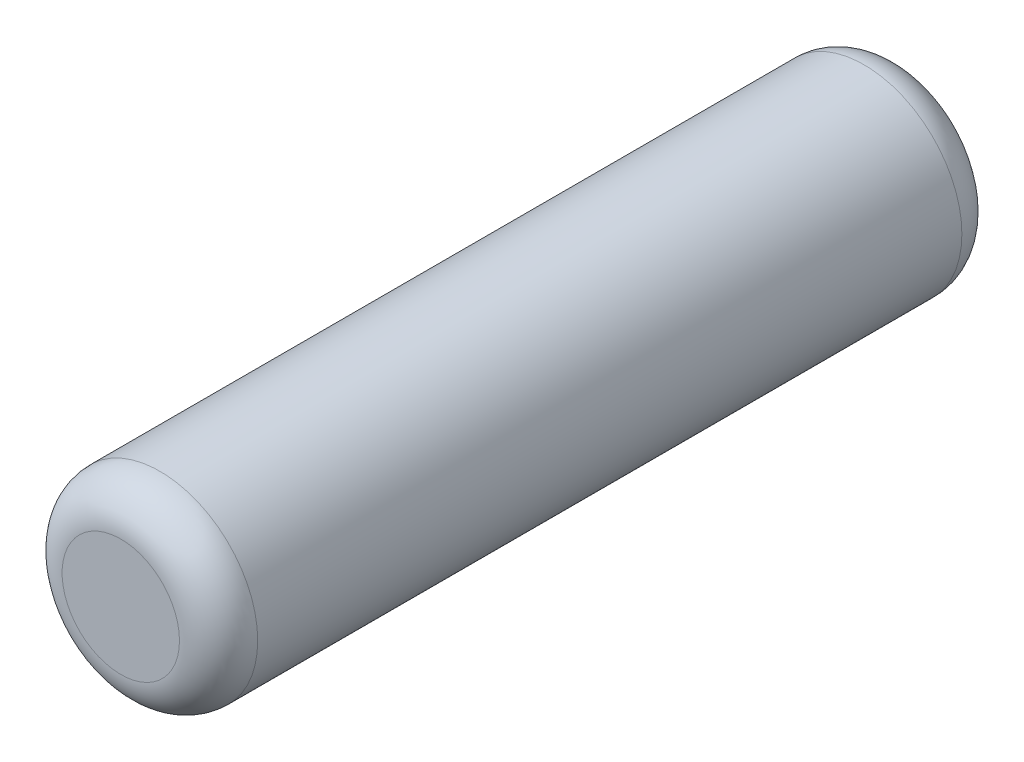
from build123d import *

# Parameters (mm, degrees)
SKIZZE1_R                    = 5
BASIS_LINEAR_AUSTRAGEN_DEPTH = 20
VERRUNDUNG1_R                = 2


with BuildPart() as part:
    # Skizze1 → Basis-Linear austragen (new, symmetric)
    with BuildSketch(Plane.XY):
        Circle(SKIZZE1_R)
    extrude(amount=BASIS_LINEAR_AUSTRAGEN_DEPTH, both=True)

    # Verrundung1
    verrundung1_edges = [part.edges().sort_by_distance(p)[0] for p in [
        (-5, 0, -20),
        (-5, 0, 20),
    ]]
    fillet(verrundung1_edges, radius=VERRUNDUNG1_R)


solid = part.part
